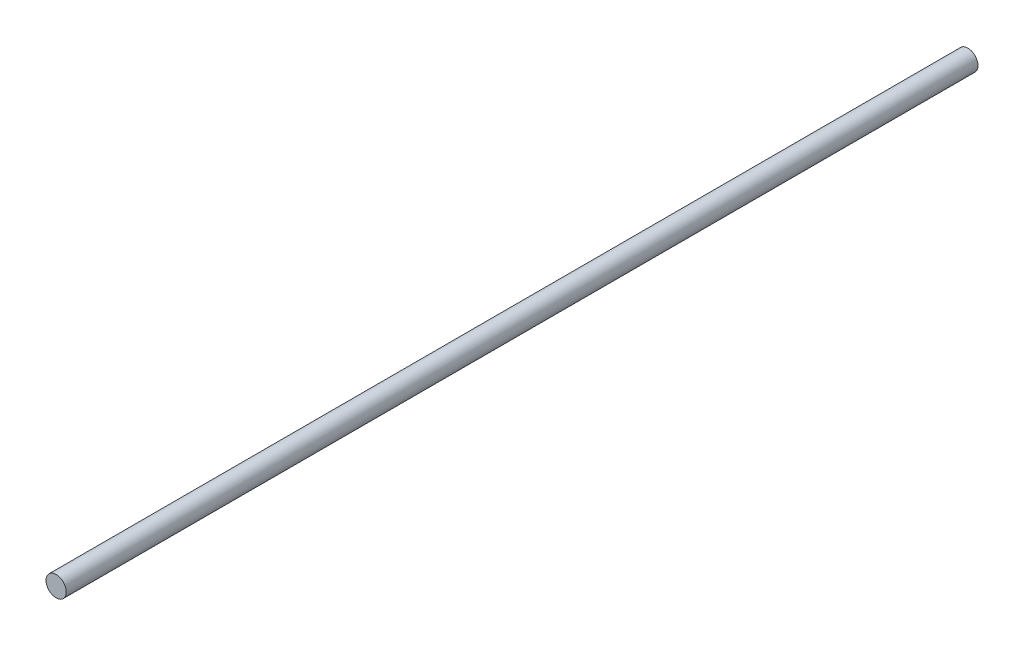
ISO-10303-21;
HEADER;
FILE_DESCRIPTION(('STEP AP214'),'2;1');
FILE_NAME('part.step','',(''),(''),'','','');
FILE_SCHEMA(('AUTOMOTIVE_DESIGN { 1 0 10303 214 1 1 1 1 }'));
ENDSEC;
DATA;
#1=APPLICATION_CONTEXT('core data for automotive mechanical design processes');
#2=APPLICATION_PROTOCOL_DEFINITION('international standard','automotive_design',2000,#1);
#3=PRODUCT_CONTEXT('',#1,'mechanical');
#4=PRODUCT('Part','Part','',(#3));
#5=PRODUCT_RELATED_PRODUCT_CATEGORY('part','',(#4));
#6=PRODUCT_DEFINITION_FORMATION('','',#4);
#7=PRODUCT_DEFINITION_CONTEXT('part definition',#1,'design');
#8=PRODUCT_DEFINITION('design','',#6,#7);
#9=PRODUCT_DEFINITION_SHAPE('','',#8);
#10=(LENGTH_UNIT() NAMED_UNIT(*) SI_UNIT(.MILLI.,.METRE.));
#11=(NAMED_UNIT(*) PLANE_ANGLE_UNIT() SI_UNIT($,.RADIAN.));
#12=(NAMED_UNIT(*) SI_UNIT($,.STERADIAN.) SOLID_ANGLE_UNIT());
#13=UNCERTAINTY_MEASURE_WITH_UNIT(LENGTH_MEASURE(1.E-05),#10,'distance_accuracy_value','');
#14=(GEOMETRIC_REPRESENTATION_CONTEXT(3) GLOBAL_UNCERTAINTY_ASSIGNED_CONTEXT((#13)) GLOBAL_UNIT_ASSIGNED_CONTEXT((#10,
#11,#12)) REPRESENTATION_CONTEXT('',''));
#15=CARTESIAN_POINT('',(0.,0.,0.));
#16=DIRECTION('',(0.,0.,1.));
#17=DIRECTION('',(1.,0.,0.));
#18=AXIS2_PLACEMENT_3D('',#15,#16,#17);
#19=CARTESIAN_POINT('',(0.,0.,-2700.));
#20=DIRECTION('',(0.,0.,1.));
#21=DIRECTION('',(1.,0.,0.));
#22=AXIS2_PLACEMENT_3D('',#19,#20,#21);
#23=CYLINDRICAL_SURFACE('',#22,30.);
#24=CARTESIAN_POINT('',(0.,0.,-2700.));
#25=DIRECTION('',(0.,0.,1.));
#26=DIRECTION('',(1.,0.,0.));
#27=AXIS2_PLACEMENT_3D('',#24,#25,#26);
#28=CIRCLE('',#27,30.);
#29=CARTESIAN_POINT('',(30.,0.,-2700.));
#30=VERTEX_POINT('',#29);
#31=EDGE_CURVE('E10',#30,#30,#28,.T.);
#32=ORIENTED_EDGE('',*,*,#31,.T.);
#33=EDGE_LOOP('',(#32));
#34=FACE_BOUND('',#33,.T.);
#35=CARTESIAN_POINT('',(0.,0.,0.));
#36=DIRECTION('',(0.,0.,1.));
#37=DIRECTION('',(1.,0.,0.));
#38=AXIS2_PLACEMENT_3D('',#35,#36,#37);
#39=CIRCLE('',#38,30.);
#40=CARTESIAN_POINT('',(30.,0.,0.));
#41=VERTEX_POINT('',#40);
#42=EDGE_CURVE('E40',#41,#41,#39,.T.);
#43=ORIENTED_EDGE('',*,*,#42,.F.);
#44=EDGE_LOOP('',(#43));
#45=FACE_BOUND('',#44,.T.);
#46=ADVANCED_FACE('F37',(#34,#45),#23,.T.);
#47=CARTESIAN_POINT('',(0.,0.,-2700.));
#48=DIRECTION('',(0.,0.,1.));
#49=DIRECTION('',(1.,0.,0.));
#50=AXIS2_PLACEMENT_3D('',#47,#48,#49);
#51=PLANE('',#50);
#52=ORIENTED_EDGE('',*,*,#31,.F.);
#53=EDGE_LOOP('',(#52));
#54=FACE_BOUND('',#53,.T.);
#55=ADVANCED_FACE('F54',(#54),#51,.F.);
#56=CARTESIAN_POINT('',(0.,0.,0.));
#57=DIRECTION('',(0.,0.,1.));
#58=DIRECTION('',(1.,0.,0.));
#59=AXIS2_PLACEMENT_3D('',#56,#57,#58);
#60=PLANE('',#59);
#61=ORIENTED_EDGE('',*,*,#42,.T.);
#62=EDGE_LOOP('',(#61));
#63=FACE_BOUND('',#62,.T.);
#64=ADVANCED_FACE('F51',(#63),#60,.T.);
#65=CLOSED_SHELL('',(#46,#55,#64));
#66=MANIFOLD_SOLID_BREP('B2',#65);
#67=ADVANCED_BREP_SHAPE_REPRESENTATION('',(#18,#66),#14);
#68=SHAPE_DEFINITION_REPRESENTATION(#9,#67);
ENDSEC;
END-ISO-10303-21;
